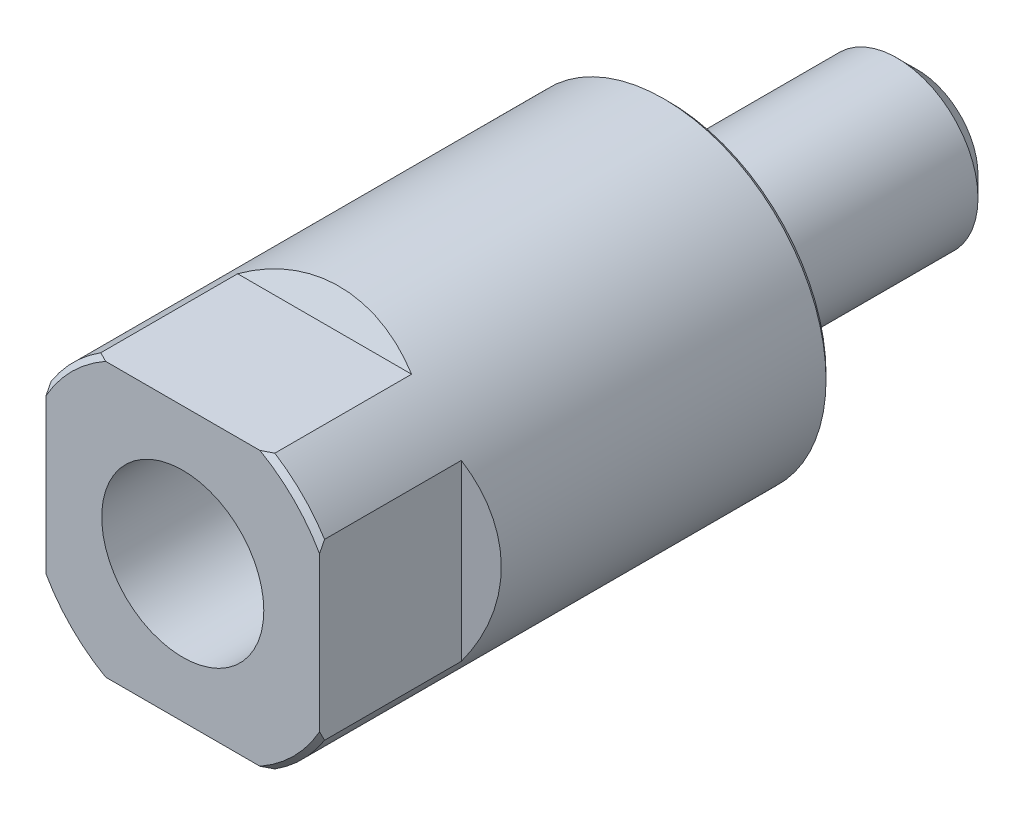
ISO-10303-21;
HEADER;
FILE_DESCRIPTION(('STEP AP214'),'2;1');
FILE_NAME('part.step','',(''),(''),'','','');
FILE_SCHEMA(('AUTOMOTIVE_DESIGN { 1 0 10303 214 1 1 1 1 }'));
ENDSEC;
DATA;
#1=APPLICATION_CONTEXT('core data for automotive mechanical design processes');
#2=APPLICATION_PROTOCOL_DEFINITION('international standard','automotive_design',2000,#1);
#3=PRODUCT_CONTEXT('',#1,'mechanical');
#4=PRODUCT('Part','Part','',(#3));
#5=PRODUCT_RELATED_PRODUCT_CATEGORY('part','',(#4));
#6=PRODUCT_DEFINITION_FORMATION('','',#4);
#7=PRODUCT_DEFINITION_CONTEXT('part definition',#1,'design');
#8=PRODUCT_DEFINITION('design','',#6,#7);
#9=PRODUCT_DEFINITION_SHAPE('','',#8);
#10=(LENGTH_UNIT() NAMED_UNIT(*) SI_UNIT(.MILLI.,.METRE.));
#11=(NAMED_UNIT(*) PLANE_ANGLE_UNIT() SI_UNIT($,.RADIAN.));
#12=(NAMED_UNIT(*) SI_UNIT($,.STERADIAN.) SOLID_ANGLE_UNIT());
#13=UNCERTAINTY_MEASURE_WITH_UNIT(LENGTH_MEASURE(1.E-05),#10,'distance_accuracy_value','');
#14=(GEOMETRIC_REPRESENTATION_CONTEXT(3) GLOBAL_UNCERTAINTY_ASSIGNED_CONTEXT((#13)) GLOBAL_UNIT_ASSIGNED_CONTEXT((#10,
#11,#12)) REPRESENTATION_CONTEXT('',''));
#15=CARTESIAN_POINT('',(0.,0.,0.));
#16=DIRECTION('',(0.,0.,1.));
#17=DIRECTION('',(1.,0.,0.));
#18=AXIS2_PLACEMENT_3D('',#15,#16,#17);
#19=CARTESIAN_POINT('',(0.,0.,-24.5));
#20=DIRECTION('',(0.,0.,1.));
#21=DIRECTION('',(1.,0.,0.));
#22=AXIS2_PLACEMENT_3D('',#19,#20,#21);
#23=PLANE('',#22);
#24=CARTESIAN_POINT('',(0.,0.,-24.5));
#25=DIRECTION('',(0.,0.,1.));
#26=DIRECTION('',(1.,0.,0.));
#27=AXIS2_PLACEMENT_3D('',#24,#25,#26);
#28=CIRCLE('',#27,6.);
#29=CARTESIAN_POINT('',(6.,0.,-24.5));
#30=VERTEX_POINT('',#29);
#31=EDGE_CURVE('E139',#30,#30,#28,.F.);
#32=ORIENTED_EDGE('',*,*,#31,.T.);
#33=EDGE_LOOP('',(#32));
#34=FACE_BOUND('',#33,.T.);
#35=ADVANCED_FACE('F14',(#34),#23,.F.);
#36=CARTESIAN_POINT('',(0.,0.,-4.5));
#37=DIRECTION('',(0.,0.,1.));
#38=DIRECTION('',(1.,0.,0.));
#39=AXIS2_PLACEMENT_3D('',#36,#37,#38);
#40=CYLINDRICAL_SURFACE('',#39,8.);
#41=CARTESIAN_POINT('',(0.,0.,-22.5));
#42=DIRECTION('',(0.,0.,1.));
#43=DIRECTION('',(1.,0.,0.));
#44=AXIS2_PLACEMENT_3D('',#41,#42,#43);
#45=CIRCLE('',#44,8.);
#46=CARTESIAN_POINT('',(8.,0.,-22.5));
#47=VERTEX_POINT('',#46);
#48=EDGE_CURVE('E176',#47,#47,#45,.T.);
#49=ORIENTED_EDGE('',*,*,#48,.T.);
#50=EDGE_LOOP('',(#49));
#51=FACE_BOUND('',#50,.T.);
#52=CARTESIAN_POINT('',(0.,0.,0.));
#53=DIRECTION('',(0.,0.,1.));
#54=DIRECTION('',(1.,0.,0.));
#55=AXIS2_PLACEMENT_3D('',#52,#53,#54);
#56=CIRCLE('',#55,8.);
#57=CARTESIAN_POINT('',(8.,0.,0.));
#58=VERTEX_POINT('',#57);
#59=EDGE_CURVE('E136',#58,#58,#56,.T.);
#60=ORIENTED_EDGE('',*,*,#59,.F.);
#61=EDGE_LOOP('',(#60));
#62=FACE_BOUND('',#61,.T.);
#63=ADVANCED_FACE('F239',(#51,#62),#40,.T.);
#64=CARTESIAN_POINT('',(8.,0.,15.5));
#65=DIRECTION('',(0.,0.,-1.));
#66=DIRECTION('',(-1.,0.,0.));
#67=AXIS2_PLACEMENT_3D('',#64,#65,#66);
#68=PLANE('',#67);
#69=CARTESIAN_POINT('',(0.,0.,15.5));
#70=DIRECTION('',(0.,0.,1.));
#71=DIRECTION('',(1.,0.,0.));
#72=AXIS2_PLACEMENT_3D('',#69,#70,#71);
#73=CIRCLE('',#72,8.);
#74=CARTESIAN_POINT('',(8.,0.,15.5));
#75=VERTEX_POINT('',#74);
#76=EDGE_CURVE('E122',#75,#75,#73,.T.);
#77=ORIENTED_EDGE('',*,*,#76,.T.);
#78=EDGE_LOOP('',(#77));
#79=FACE_BOUND('',#78,.T.);
#80=ADVANCED_FACE('F223',(#79),#68,.F.);
#81=CARTESIAN_POINT('',(13.5,-16.,34.));
#82=DIRECTION('',(-0.500000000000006,0.,-0.866025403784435));
#83=DIRECTION('',(-0.866025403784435,0.,0.500000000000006));
#84=AXIS2_PLACEMENT_3D('',#81,#82,#83);
#85=PLANE('',#84);
#86=CARTESIAN_POINT('',(0.,0.,41.7942286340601));
#87=DIRECTION('',(-0.500000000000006,0.,-0.866025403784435));
#88=DIRECTION('',(0.866025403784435,0.,-0.500000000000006));
#89=AXIS2_PLACEMENT_3D('',#86,#87,#88);
#90=ELLIPSE('',#89,18.4752086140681,16.);
#91=CARTESIAN_POINT('',(13.5,8.58778201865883,34.));
#92=VERTEX_POINT('',#91);
#93=CARTESIAN_POINT('',(13.5,-8.58778201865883,34.));
#94=VERTEX_POINT('',#93);
#95=EDGE_CURVE('E159',#92,#94,#90,.T.);
#96=ORIENTED_EDGE('',*,*,#95,.F.);
#97=DIRECTION('',(0.,1.,0.));
#98=VECTOR('',#97,1.);
#99=CARTESIAN_POINT('',(13.5,-16.,34.));
#100=LINE('',#99,#98);
#101=EDGE_CURVE('E149',#94,#92,#100,.T.);
#102=ORIENTED_EDGE('',*,*,#101,.F.);
#103=EDGE_LOOP('',(#96,#102));
#104=FACE_BOUND('',#103,.T.);
#105=ADVANCED_FACE('F214',(#104),#85,.F.);
#106=CARTESIAN_POINT('',(13.5,-16.,48.));
#107=DIRECTION('',(-1.,0.,0.));
#108=DIRECTION('',(0.,0.,1.));
#109=AXIS2_PLACEMENT_3D('',#106,#107,#108);
#110=PLANE('',#109);
#111=DIRECTION('',(0.,-1.,0.));
#112=VECTOR('',#111,1.);
#113=CARTESIAN_POINT('',(13.5,0.,48.));
#114=LINE('',#113,#112);
#115=CARTESIAN_POINT('',(13.5,7.61577310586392,48.));
#116=VERTEX_POINT('',#115);
#117=CARTESIAN_POINT('',(13.5,-7.61577310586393,48.));
#118=VERTEX_POINT('',#117);
#119=EDGE_CURVE('E156',#116,#118,#114,.T.);
#120=ORIENTED_EDGE('',*,*,#119,.T.);
#121=CARTESIAN_POINT('',(13.5,-7.61577310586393,48.));
#122=CARTESIAN_POINT('',(13.5,-7.6975348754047,47.9598269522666));
#123=CARTESIAN_POINT('',(13.5,-7.77910228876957,47.919259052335));
#124=CARTESIAN_POINT('',(13.5,-7.94184922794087,47.8373685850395));
#125=CARTESIAN_POINT('',(13.5,-8.02302878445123,47.7960460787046));
#126=CARTESIAN_POINT('',(13.5,-8.18501366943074,47.7126751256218));
#127=CARTESIAN_POINT('',(13.5,-8.2658189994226,47.6706266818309));
#128=CARTESIAN_POINT('',(13.5,-8.42706999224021,47.5858299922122));
#129=CARTESIAN_POINT('',(13.5,-8.50751562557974,47.5430816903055));
#130=CARTESIAN_POINT('',(13.5,-8.58778201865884,47.5));
#131=B_SPLINE_CURVE_WITH_KNOTS('',3,(#121,#122,#123,#124,#125,#126,#127,#128,#129,#130),
.UNSPECIFIED.,.F.,.F.,(4,2,2,2,4),(0.,0.273292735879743,0.546563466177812,0.819833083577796,
1.09312470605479),.UNSPECIFIED.);
#132=CARTESIAN_POINT('',(13.5,-8.58778201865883,47.5));
#133=VERTEX_POINT('',#132);
#134=EDGE_CURVE('E198',#118,#133,#131,.T.);
#135=ORIENTED_EDGE('',*,*,#134,.T.);
#136=DIRECTION('',(0.,0.,-1.));
#137=VECTOR('',#136,1.);
#138=CARTESIAN_POINT('',(13.5,-8.58778201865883,48.));
#139=LINE('',#138,#137);
#140=EDGE_CURVE('E152',#94,#133,#139,.F.);
#141=ORIENTED_EDGE('',*,*,#140,.F.);
#142=ORIENTED_EDGE('',*,*,#101,.T.);
#143=DIRECTION('',(0.,0.,-1.));
#144=VECTOR('',#143,1.);
#145=CARTESIAN_POINT('',(13.5,8.58778201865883,48.));
#146=LINE('',#145,#144);
#147=CARTESIAN_POINT('',(13.5,8.58778201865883,47.5));
#148=VERTEX_POINT('',#147);
#149=EDGE_CURVE('E154',#148,#92,#146,.T.);
#150=ORIENTED_EDGE('',*,*,#149,.F.);
#151=CARTESIAN_POINT('',(13.5,8.58778201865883,47.5));
#152=CARTESIAN_POINT('',(13.5,8.50751562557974,47.5430816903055));
#153=CARTESIAN_POINT('',(13.5,8.42706999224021,47.5858299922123));
#154=CARTESIAN_POINT('',(13.5,8.2658189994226,47.6706266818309));
#155=CARTESIAN_POINT('',(13.5,8.18501366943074,47.7126751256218));
#156=CARTESIAN_POINT('',(13.5,8.02302878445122,47.7960460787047));
#157=CARTESIAN_POINT('',(13.5,7.94184922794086,47.8373685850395));
#158=CARTESIAN_POINT('',(13.5,7.77910228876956,47.919259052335));
#159=CARTESIAN_POINT('',(13.5,7.69753487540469,47.9598269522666));
#160=CARTESIAN_POINT('',(13.5,7.61577310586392,48.));
#161=B_SPLINE_CURVE_WITH_KNOTS('',3,(#151,#152,#153,#154,#155,#156,#157,#158,#159,#160),
.UNSPECIFIED.,.F.,.F.,(4,2,2,2,4),(0.,0.273291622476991,0.546561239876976,0.819831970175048,
1.09312470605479),.UNSPECIFIED.);
#162=EDGE_CURVE('E191',#148,#116,#161,.T.);
#163=ORIENTED_EDGE('',*,*,#162,.T.);
#164=EDGE_LOOP('',(#120,#135,#141,#142,#150,#163));
#165=FACE_BOUND('',#164,.T.);
#166=ADVANCED_FACE('F208',(#165),#110,.F.);
#167=CARTESIAN_POINT('',(16.,13.5,34.));
#168=DIRECTION('',(0.,-0.500000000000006,-0.866025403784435));
#169=DIRECTION('',(0.,0.866025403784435,-0.500000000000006));
#170=AXIS2_PLACEMENT_3D('',#167,#168,#169);
#171=PLANE('',#170);
#172=CARTESIAN_POINT('',(0.,0.,41.7942286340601));
#173=DIRECTION('',(0.,-0.500000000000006,-0.866025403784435));
#174=DIRECTION('',(0.,0.866025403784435,-0.500000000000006));
#175=AXIS2_PLACEMENT_3D('',#172,#173,#174);
#176=ELLIPSE('',#175,18.4752086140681,16.);
#177=CARTESIAN_POINT('',(-8.58778201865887,13.5,34.));
#178=VERTEX_POINT('',#177);
#179=CARTESIAN_POINT('',(8.58778201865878,13.5,34.));
#180=VERTEX_POINT('',#179);
#181=EDGE_CURVE('E168',#178,#180,#176,.T.);
#182=ORIENTED_EDGE('',*,*,#181,.F.);
#183=DIRECTION('',(-1.,0.,0.));
#184=VECTOR('',#183,1.);
#185=CARTESIAN_POINT('',(16.,13.5,34.));
#186=LINE('',#185,#184);
#187=EDGE_CURVE('E115',#180,#178,#186,.T.);
#188=ORIENTED_EDGE('',*,*,#187,.F.);
#189=EDGE_LOOP('',(#182,#188));
#190=FACE_BOUND('',#189,.T.);
#191=ADVANCED_FACE('F213',(#190),#171,.F.);
#192=CARTESIAN_POINT('',(16.,13.5,48.));
#193=DIRECTION('',(0.,-1.,0.));
#194=DIRECTION('',(1.,0.,0.));
#195=AXIS2_PLACEMENT_3D('',#192,#193,#194);
#196=PLANE('',#195);
#197=DIRECTION('',(0.,0.,-1.));
#198=VECTOR('',#197,1.);
#199=CARTESIAN_POINT('',(-8.58778201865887,13.5,48.));
#200=LINE('',#199,#198);
#201=CARTESIAN_POINT('',(-8.58778201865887,13.5,47.5));
#202=VERTEX_POINT('',#201);
#203=EDGE_CURVE('E133',#202,#178,#200,.T.);
#204=ORIENTED_EDGE('',*,*,#203,.F.);
#205=CARTESIAN_POINT('',(-8.58778201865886,13.5,47.5));
#206=CARTESIAN_POINT('',(-8.50751562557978,13.4999999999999,47.5430816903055));
#207=CARTESIAN_POINT('',(-8.42706999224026,13.4999999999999,47.5858299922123));
#208=CARTESIAN_POINT('',(-8.26581899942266,13.4999999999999,47.6706266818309));
#209=CARTESIAN_POINT('',(-8.18501366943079,13.4999999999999,47.7126751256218));
#210=CARTESIAN_POINT('',(-8.02302878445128,13.4999999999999,47.7960460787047));
#211=CARTESIAN_POINT('',(-7.94184922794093,13.4999999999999,47.8373685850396));
#212=CARTESIAN_POINT('',(-7.77910228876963,13.4999999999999,47.919259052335));
#213=CARTESIAN_POINT('',(-7.69753487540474,13.4999999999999,47.9598269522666));
#214=CARTESIAN_POINT('',(-7.61577310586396,13.5,48.));
#215=B_SPLINE_CURVE_WITH_KNOTS('',3,(#205,#206,#207,#208,#209,#210,#211,#212,#213,#214),
.UNSPECIFIED.,.F.,.F.,(4,2,2,2,4),(0.,0.273291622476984,0.546561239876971,0.819831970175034,
1.09312470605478),.UNSPECIFIED.);
#216=CARTESIAN_POINT('',(-7.61577310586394,13.5,48.));
#217=VERTEX_POINT('',#216);
#218=EDGE_CURVE('E22',#202,#217,#215,.T.);
#219=ORIENTED_EDGE('',*,*,#218,.T.);
#220=DIRECTION('',(1.,0.,0.));
#221=VECTOR('',#220,1.);
#222=CARTESIAN_POINT('',(0.,13.5,48.));
#223=LINE('',#222,#221);
#224=CARTESIAN_POINT('',(7.61577310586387,13.5,48.));
#225=VERTEX_POINT('',#224);
#226=EDGE_CURVE('E166',#217,#225,#223,.T.);
#227=ORIENTED_EDGE('',*,*,#226,.T.);
#228=CARTESIAN_POINT('',(7.61577310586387,13.5,48.));
#229=CARTESIAN_POINT('',(7.69753487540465,13.5,47.9598269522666));
#230=CARTESIAN_POINT('',(7.77910228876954,13.5,47.919259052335));
#231=CARTESIAN_POINT('',(7.94184922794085,13.5,47.8373685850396));
#232=CARTESIAN_POINT('',(8.0230287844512,13.5,47.7960460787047));
#233=CARTESIAN_POINT('',(8.18501366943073,13.5,47.7126751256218));
#234=CARTESIAN_POINT('',(8.26581899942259,13.5,47.6706266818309));
#235=CARTESIAN_POINT('',(8.4270699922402,13.5,47.5858299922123));
#236=CARTESIAN_POINT('',(8.50751562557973,13.5,47.5430816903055));
#237=CARTESIAN_POINT('',(8.58778201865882,13.5,47.5));
#238=B_SPLINE_CURVE_WITH_KNOTS('',3,(#228,#229,#230,#231,#232,#233,#234,#235,#236,#237),
.UNSPECIFIED.,.F.,.F.,(4,2,2,2,4),(0.,0.273292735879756,0.546563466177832,0.819833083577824,
1.09312470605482),.UNSPECIFIED.);
#239=CARTESIAN_POINT('',(8.58778201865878,13.5,47.5));
#240=VERTEX_POINT('',#239);
#241=EDGE_CURVE('E29',#225,#240,#238,.T.);
#242=ORIENTED_EDGE('',*,*,#241,.T.);
#243=DIRECTION('',(0.,0.,-1.));
#244=VECTOR('',#243,1.);
#245=CARTESIAN_POINT('',(8.58778201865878,13.5,48.));
#246=LINE('',#245,#244);
#247=EDGE_CURVE('E131',#180,#240,#246,.F.);
#248=ORIENTED_EDGE('',*,*,#247,.F.);
#249=ORIENTED_EDGE('',*,*,#187,.T.);
#250=EDGE_LOOP('',(#204,#219,#227,#242,#248,#249));
#251=FACE_BOUND('',#250,.T.);
#252=ADVANCED_FACE('F283',(#251),#196,.F.);
#253=CARTESIAN_POINT('',(-13.5,-16.,34.));
#254=DIRECTION('',(0.5,0.,-0.866025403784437));
#255=DIRECTION('',(-0.866025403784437,0.,-0.5));
#256=AXIS2_PLACEMENT_3D('',#253,#254,#255);
#257=PLANE('',#256);
#258=CARTESIAN_POINT('',(0.,0.,41.79422863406));
#259=DIRECTION('',(0.5,0.,-0.866025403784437));
#260=DIRECTION('',(-0.866025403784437,0.,-0.5));
#261=AXIS2_PLACEMENT_3D('',#258,#259,#260);
#262=ELLIPSE('',#261,18.475208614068,16.);
#263=CARTESIAN_POINT('',(-13.5,-8.58778201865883,34.));
#264=VERTEX_POINT('',#263);
#265=CARTESIAN_POINT('',(-13.5,8.58778201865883,34.));
#266=VERTEX_POINT('',#265);
#267=EDGE_CURVE('E164',#264,#266,#262,.T.);
#268=ORIENTED_EDGE('',*,*,#267,.F.);
#269=DIRECTION('',(0.,1.,0.));
#270=VECTOR('',#269,1.);
#271=CARTESIAN_POINT('',(-13.5,-16.,34.));
#272=LINE('',#271,#270);
#273=EDGE_CURVE('E142',#264,#266,#272,.T.);
#274=ORIENTED_EDGE('',*,*,#273,.T.);
#275=EDGE_LOOP('',(#268,#274));
#276=FACE_BOUND('',#275,.T.);
#277=ADVANCED_FACE('F216',(#276),#257,.F.);
#278=CARTESIAN_POINT('',(-13.5,-16.,48.));
#279=DIRECTION('',(1.,0.,0.));
#280=DIRECTION('',(0.,0.,-1.));
#281=AXIS2_PLACEMENT_3D('',#278,#279,#280);
#282=PLANE('',#281);
#283=DIRECTION('',(0.,0.,-1.));
#284=VECTOR('',#283,1.);
#285=CARTESIAN_POINT('',(-13.5,-8.58778201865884,48.));
#286=LINE('',#285,#284);
#287=CARTESIAN_POINT('',(-13.5,-8.58778201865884,47.5));
#288=VERTEX_POINT('',#287);
#289=EDGE_CURVE('E147',#288,#264,#286,.T.);
#290=ORIENTED_EDGE('',*,*,#289,.F.);
#291=CARTESIAN_POINT('',(-13.5,-8.58778201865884,47.5));
#292=CARTESIAN_POINT('',(-13.5,-8.50751562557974,47.5430816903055));
#293=CARTESIAN_POINT('',(-13.5,-8.42706999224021,47.5858299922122));
#294=CARTESIAN_POINT('',(-13.5,-8.2658189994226,47.6706266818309));
#295=CARTESIAN_POINT('',(-13.5,-8.18501366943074,47.7126751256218));
#296=CARTESIAN_POINT('',(-13.5,-8.02302878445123,47.7960460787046));
#297=CARTESIAN_POINT('',(-13.5,-7.94184922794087,47.8373685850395));
#298=CARTESIAN_POINT('',(-13.5,-7.77910228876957,47.919259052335));
#299=CARTESIAN_POINT('',(-13.5,-7.6975348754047,47.9598269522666));
#300=CARTESIAN_POINT('',(-13.5,-7.61577310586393,48.));
#301=B_SPLINE_CURVE_WITH_KNOTS('',3,(#291,#292,#293,#294,#295,#296,#297,#298,#299,#300),
.UNSPECIFIED.,.F.,.F.,(4,2,2,2,4),(0.,0.273291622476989,0.546561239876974,0.819831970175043,
1.09312470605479),.UNSPECIFIED.);
#302=CARTESIAN_POINT('',(-13.5,-7.61577310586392,48.));
#303=VERTEX_POINT('',#302);
#304=EDGE_CURVE('E323',#288,#303,#301,.T.);
#305=ORIENTED_EDGE('',*,*,#304,.T.);
#306=DIRECTION('',(0.,1.,0.));
#307=VECTOR('',#306,1.);
#308=CARTESIAN_POINT('',(-13.5,0.,48.));
#309=LINE('',#308,#307);
#310=CARTESIAN_POINT('',(-13.5,7.61577310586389,48.));
#311=VERTEX_POINT('',#310);
#312=EDGE_CURVE('E161',#303,#311,#309,.T.);
#313=ORIENTED_EDGE('',*,*,#312,.T.);
#314=CARTESIAN_POINT('',(-13.5,7.61577310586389,48.));
#315=CARTESIAN_POINT('',(-13.5,7.69753487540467,47.9598269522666));
#316=CARTESIAN_POINT('',(-13.5,7.77910228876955,47.919259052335));
#317=CARTESIAN_POINT('',(-13.5,7.94184922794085,47.8373685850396));
#318=CARTESIAN_POINT('',(-13.5,8.02302878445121,47.7960460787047));
#319=CARTESIAN_POINT('',(-13.5,8.18501366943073,47.7126751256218));
#320=CARTESIAN_POINT('',(-13.5,8.2658189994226,47.6706266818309));
#321=CARTESIAN_POINT('',(-13.5,8.42706999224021,47.5858299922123));
#322=CARTESIAN_POINT('',(-13.5,8.50751562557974,47.5430816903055));
#323=CARTESIAN_POINT('',(-13.5,8.58778201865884,47.5));
#324=B_SPLINE_CURVE_WITH_KNOTS('',3,(#314,#315,#316,#317,#318,#319,#320,#321,#322,#323),
.UNSPECIFIED.,.F.,.F.,(4,2,2,2,4),(0.,0.273292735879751,0.546563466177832,0.819833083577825,
1.09312470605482),.UNSPECIFIED.);
#325=CARTESIAN_POINT('',(-13.5,8.58778201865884,47.5));
#326=VERTEX_POINT('',#325);
#327=EDGE_CURVE('E267',#311,#326,#324,.T.);
#328=ORIENTED_EDGE('',*,*,#327,.T.);
#329=DIRECTION('',(0.,0.,-1.));
#330=VECTOR('',#329,1.);
#331=CARTESIAN_POINT('',(-13.5,8.58778201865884,48.));
#332=LINE('',#331,#330);
#333=EDGE_CURVE('E145',#266,#326,#332,.F.);
#334=ORIENTED_EDGE('',*,*,#333,.F.);
#335=ORIENTED_EDGE('',*,*,#273,.F.);
#336=EDGE_LOOP('',(#290,#305,#313,#328,#334,#335));
#337=FACE_BOUND('',#336,.T.);
#338=ADVANCED_FACE('F217',(#337),#282,.F.);
#339=CARTESIAN_POINT('',(16.,-13.5,34.));
#340=DIRECTION('',(0.,0.5,-0.866025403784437));
#341=DIRECTION('',(0.,0.866025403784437,0.5));
#342=AXIS2_PLACEMENT_3D('',#339,#340,#341);
#343=PLANE('',#342);
#344=CARTESIAN_POINT('',(0.,0.,41.79422863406));
#345=DIRECTION('',(0.,0.5,-0.866025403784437));
#346=DIRECTION('',(0.,-0.866025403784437,-0.5));
#347=AXIS2_PLACEMENT_3D('',#344,#345,#346);
#348=ELLIPSE('',#347,18.475208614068,16.);
#349=CARTESIAN_POINT('',(8.58778201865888,-13.5,34.));
#350=VERTEX_POINT('',#349);
#351=CARTESIAN_POINT('',(-8.58778201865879,-13.5,34.));
#352=VERTEX_POINT('',#351);
#353=EDGE_CURVE('E108',#350,#352,#348,.T.);
#354=ORIENTED_EDGE('',*,*,#353,.F.);
#355=DIRECTION('',(-1.,0.,0.));
#356=VECTOR('',#355,1.);
#357=CARTESIAN_POINT('',(16.,-13.5,34.));
#358=LINE('',#357,#356);
#359=EDGE_CURVE('E121',#350,#352,#358,.T.);
#360=ORIENTED_EDGE('',*,*,#359,.T.);
#361=EDGE_LOOP('',(#354,#360));
#362=FACE_BOUND('',#361,.T.);
#363=ADVANCED_FACE('F120',(#362),#343,.F.);
#364=CARTESIAN_POINT('',(16.,-13.5,48.));
#365=DIRECTION('',(0.,1.,0.));
#366=DIRECTION('',(-1.,0.,0.));
#367=AXIS2_PLACEMENT_3D('',#364,#365,#366);
#368=PLANE('',#367);
#369=DIRECTION('',(0.,0.,-1.));
#370=VECTOR('',#369,1.);
#371=CARTESIAN_POINT('',(8.58778201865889,-13.5,48.));
#372=LINE('',#371,#370);
#373=CARTESIAN_POINT('',(8.58778201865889,-13.5,47.5));
#374=VERTEX_POINT('',#373);
#375=EDGE_CURVE('E103',#374,#350,#372,.T.);
#376=ORIENTED_EDGE('',*,*,#375,.F.);
#377=CARTESIAN_POINT('',(8.58778201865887,-13.5,47.5));
#378=CARTESIAN_POINT('',(8.50751562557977,-13.5,47.5430816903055));
#379=CARTESIAN_POINT('',(8.42706999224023,-13.5,47.5858299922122));
#380=CARTESIAN_POINT('',(8.26581899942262,-13.5,47.6706266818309));
#381=CARTESIAN_POINT('',(8.18501366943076,-13.5,47.7126751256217));
#382=CARTESIAN_POINT('',(8.02302878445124,-13.5,47.7960460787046));
#383=CARTESIAN_POINT('',(7.94184922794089,-13.5,47.8373685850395));
#384=CARTESIAN_POINT('',(7.77910228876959,-13.5,47.919259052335));
#385=CARTESIAN_POINT('',(7.69753487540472,-13.5,47.9598269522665));
#386=CARTESIAN_POINT('',(7.61577310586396,-13.5,48.));
#387=B_SPLINE_CURVE_WITH_KNOTS('',3,(#377,#378,#379,#380,#381,#382,#383,#384,#385,#386),
.UNSPECIFIED.,.F.,.F.,(4,2,2,2,4),(0.,0.27329162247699,0.546561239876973,0.819831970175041,
1.09312470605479),.UNSPECIFIED.);
#388=CARTESIAN_POINT('',(7.61577310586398,-13.5,48.));
#389=VERTEX_POINT('',#388);
#390=EDGE_CURVE('E259',#374,#389,#387,.T.);
#391=ORIENTED_EDGE('',*,*,#390,.T.);
#392=DIRECTION('',(-1.,0.,0.));
#393=VECTOR('',#392,1.);
#394=CARTESIAN_POINT('',(0.,-13.5,48.));
#395=LINE('',#394,#393);
#396=CARTESIAN_POINT('',(-7.61577310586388,-13.5,48.));
#397=VERTEX_POINT('',#396);
#398=EDGE_CURVE('E123',#389,#397,#395,.T.);
#399=ORIENTED_EDGE('',*,*,#398,.T.);
#400=CARTESIAN_POINT('',(-7.61577310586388,-13.5,48.));
#401=CARTESIAN_POINT('',(-7.69753487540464,-13.5000000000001,47.9598269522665));
#402=CARTESIAN_POINT('',(-7.77910228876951,-13.5000000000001,47.919259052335));
#403=CARTESIAN_POINT('',(-7.9418492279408,-13.5000000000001,47.8373685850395));
#404=CARTESIAN_POINT('',(-8.02302878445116,-13.5000000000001,47.7960460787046));
#405=CARTESIAN_POINT('',(-8.18501366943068,-13.5000000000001,47.7126751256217));
#406=CARTESIAN_POINT('',(-8.26581899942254,-13.5000000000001,47.6706266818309));
#407=CARTESIAN_POINT('',(-8.42706999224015,-13.5000000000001,47.5858299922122));
#408=CARTESIAN_POINT('',(-8.50751562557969,-13.5000000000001,47.5430816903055));
#409=CARTESIAN_POINT('',(-8.58778201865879,-13.5,47.5));
#410=B_SPLINE_CURVE_WITH_KNOTS('',3,(#400,#401,#402,#403,#404,#405,#406,#407,#408,#409),
.UNSPECIFIED.,.F.,.F.,(4,2,2,2,4),(0.,0.273292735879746,0.546563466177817,0.819833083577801,
1.09312470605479),.UNSPECIFIED.);
#411=CARTESIAN_POINT('',(-8.5877820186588,-13.5,47.5));
#412=VERTEX_POINT('',#411);
#413=EDGE_CURVE('E268',#397,#412,#410,.T.);
#414=ORIENTED_EDGE('',*,*,#413,.T.);
#415=DIRECTION('',(0.,0.,-1.));
#416=VECTOR('',#415,1.);
#417=CARTESIAN_POINT('',(-8.5877820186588,-13.5,48.));
#418=LINE('',#417,#416);
#419=EDGE_CURVE('E116',#352,#412,#418,.F.);
#420=ORIENTED_EDGE('',*,*,#419,.F.);
#421=ORIENTED_EDGE('',*,*,#359,.F.);
#422=EDGE_LOOP('',(#376,#391,#399,#414,#420,#421));
#423=FACE_BOUND('',#422,.T.);
#424=ADVANCED_FACE('F125',(#423),#368,.F.);
#425=CARTESIAN_POINT('',(0.,0.,48.));
#426=DIRECTION('',(0.,0.,-1.));
#427=DIRECTION('',(-1.,0.,0.));
#428=AXIS2_PLACEMENT_3D('',#425,#426,#427);
#429=CYLINDRICAL_SURFACE('',#428,16.);
#430=CARTESIAN_POINT('',(0.,0.,0.499999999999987));
#431=DIRECTION('',(0.,0.,1.));
#432=DIRECTION('',(1.,0.,0.));
#433=AXIS2_PLACEMENT_3D('',#430,#431,#432);
#434=CIRCLE('',#433,16.);
#435=CARTESIAN_POINT('',(16.,0.,0.499999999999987));
#436=VERTEX_POINT('',#435);
#437=EDGE_CURVE('E343',#436,#436,#434,.T.);
#438=ORIENTED_EDGE('',*,*,#437,.T.);
#439=EDGE_LOOP('',(#438));
#440=FACE_BOUND('',#439,.T.);
#441=ORIENTED_EDGE('',*,*,#140,.T.);
#442=CARTESIAN_POINT('',(0.,0.,47.5));
#443=DIRECTION('',(0.,0.,1.));
#444=DIRECTION('',(1.,0.,0.));
#445=AXIS2_PLACEMENT_3D('',#442,#443,#444);
#446=CIRCLE('',#445,16.);
#447=EDGE_CURVE('E111',#133,#374,#446,.F.);
#448=ORIENTED_EDGE('',*,*,#447,.T.);
#449=ORIENTED_EDGE('',*,*,#375,.T.);
#450=ORIENTED_EDGE('',*,*,#353,.T.);
#451=ORIENTED_EDGE('',*,*,#419,.T.);
#452=CARTESIAN_POINT('',(0.,0.,47.5));
#453=DIRECTION('',(0.,0.,1.));
#454=DIRECTION('',(1.,0.,0.));
#455=AXIS2_PLACEMENT_3D('',#452,#453,#454);
#456=CIRCLE('',#455,16.);
#457=EDGE_CURVE('E337',#412,#288,#456,.F.);
#458=ORIENTED_EDGE('',*,*,#457,.T.);
#459=ORIENTED_EDGE('',*,*,#289,.T.);
#460=ORIENTED_EDGE('',*,*,#267,.T.);
#461=ORIENTED_EDGE('',*,*,#333,.T.);
#462=CARTESIAN_POINT('',(0.,0.,47.5));
#463=DIRECTION('',(0.,0.,1.));
#464=DIRECTION('',(1.,0.,0.));
#465=AXIS2_PLACEMENT_3D('',#462,#463,#464);
#466=CIRCLE('',#465,16.);
#467=EDGE_CURVE('E37',#326,#202,#466,.F.);
#468=ORIENTED_EDGE('',*,*,#467,.T.);
#469=ORIENTED_EDGE('',*,*,#203,.T.);
#470=ORIENTED_EDGE('',*,*,#181,.T.);
#471=ORIENTED_EDGE('',*,*,#247,.T.);
#472=CARTESIAN_POINT('',(0.,0.,47.5));
#473=DIRECTION('',(0.,0.,1.));
#474=DIRECTION('',(1.,0.,0.));
#475=AXIS2_PLACEMENT_3D('',#472,#473,#474);
#476=CIRCLE('',#475,16.);
#477=EDGE_CURVE('E322',#240,#148,#476,.F.);
#478=ORIENTED_EDGE('',*,*,#477,.T.);
#479=ORIENTED_EDGE('',*,*,#149,.T.);
#480=ORIENTED_EDGE('',*,*,#95,.T.);
#481=EDGE_LOOP('',(#441,#448,#449,#450,#451,#458,#459,#460,#461,#468,#469,#470,#471,#478,#479,#480));
#482=FACE_BOUND('',#481,.T.);
#483=ADVANCED_FACE('F106',(#440,#482),#429,.T.);
#484=CARTESIAN_POINT('',(0.,0.,0.));
#485=DIRECTION('',(0.,0.,1.));
#486=DIRECTION('',(1.,0.,0.));
#487=AXIS2_PLACEMENT_3D('',#484,#485,#486);
#488=PLANE('',#487);
#489=CARTESIAN_POINT('',(0.,0.,0.));
#490=DIRECTION('',(0.,0.,1.));
#491=DIRECTION('',(1.,0.,0.));
#492=AXIS2_PLACEMENT_3D('',#489,#490,#491);
#493=CIRCLE('',#492,15.5);
#494=CARTESIAN_POINT('',(15.5,0.,0.));
#495=VERTEX_POINT('',#494);
#496=EDGE_CURVE('E9',#495,#495,#493,.F.);
#497=ORIENTED_EDGE('',*,*,#496,.T.);
#498=EDGE_LOOP('',(#497));
#499=FACE_BOUND('',#498,.T.);
#500=ORIENTED_EDGE('',*,*,#59,.T.);
#501=EDGE_LOOP('',(#500));
#502=FACE_BOUND('',#501,.T.);
#503=ADVANCED_FACE('F225',(#499,#502),#488,.F.);
#504=CARTESIAN_POINT('',(0.,0.,48.));
#505=DIRECTION('',(0.,0.,1.));
#506=DIRECTION('',(1.,0.,0.));
#507=AXIS2_PLACEMENT_3D('',#504,#505,#506);
#508=PLANE('',#507);
#509=ORIENTED_EDGE('',*,*,#398,.F.);
#510=CARTESIAN_POINT('',(0.,0.,48.));
#511=DIRECTION('',(0.,0.,1.));
#512=DIRECTION('',(1.,0.,0.));
#513=AXIS2_PLACEMENT_3D('',#510,#511,#512);
#514=CIRCLE('',#513,15.5);
#515=EDGE_CURVE('E188',#389,#118,#514,.T.);
#516=ORIENTED_EDGE('',*,*,#515,.T.);
#517=ORIENTED_EDGE('',*,*,#119,.F.);
#518=CARTESIAN_POINT('',(0.,0.,48.));
#519=DIRECTION('',(0.,0.,1.));
#520=DIRECTION('',(1.,0.,0.));
#521=AXIS2_PLACEMENT_3D('',#518,#519,#520);
#522=CIRCLE('',#521,15.5);
#523=EDGE_CURVE('E179',#116,#225,#522,.T.);
#524=ORIENTED_EDGE('',*,*,#523,.T.);
#525=ORIENTED_EDGE('',*,*,#226,.F.);
#526=CARTESIAN_POINT('',(0.,0.,48.));
#527=DIRECTION('',(0.,0.,1.));
#528=DIRECTION('',(1.,0.,0.));
#529=AXIS2_PLACEMENT_3D('',#526,#527,#528);
#530=CIRCLE('',#529,15.5);
#531=EDGE_CURVE('E182',#217,#311,#530,.T.);
#532=ORIENTED_EDGE('',*,*,#531,.T.);
#533=ORIENTED_EDGE('',*,*,#312,.F.);
#534=CARTESIAN_POINT('',(0.,0.,48.));
#535=DIRECTION('',(0.,0.,1.));
#536=DIRECTION('',(1.,0.,0.));
#537=AXIS2_PLACEMENT_3D('',#534,#535,#536);
#538=CIRCLE('',#537,15.5);
#539=EDGE_CURVE('E185',#303,#397,#538,.T.);
#540=ORIENTED_EDGE('',*,*,#539,.T.);
#541=EDGE_LOOP('',(#509,#516,#517,#524,#525,#532,#533,#540));
#542=FACE_BOUND('',#541,.T.);
#543=CARTESIAN_POINT('',(0.,0.,48.));
#544=DIRECTION('',(0.,0.,1.));
#545=DIRECTION('',(1.,0.,0.));
#546=AXIS2_PLACEMENT_3D('',#543,#544,#545);
#547=CIRCLE('',#546,8.);
#548=CARTESIAN_POINT('',(8.,0.,48.));
#549=VERTEX_POINT('',#548);
#550=EDGE_CURVE('E135',#549,#549,#547,.T.);
#551=ORIENTED_EDGE('',*,*,#550,.F.);
#552=EDGE_LOOP('',(#551));
#553=FACE_BOUND('',#552,.T.);
#554=ADVANCED_FACE('F228',(#542,#553),#508,.T.);
#555=CARTESIAN_POINT('',(0.,0.,48.));
#556=DIRECTION('',(0.,0.,1.));
#557=DIRECTION('',(1.,0.,0.));
#558=AXIS2_PLACEMENT_3D('',#555,#556,#557);
#559=CYLINDRICAL_SURFACE('',#558,8.);
#560=ORIENTED_EDGE('',*,*,#76,.F.);
#561=EDGE_LOOP('',(#560));
#562=FACE_BOUND('',#561,.T.);
#563=ORIENTED_EDGE('',*,*,#550,.T.);
#564=EDGE_LOOP('',(#563));
#565=FACE_BOUND('',#564,.T.);
#566=ADVANCED_FACE('F232',(#562,#565),#559,.F.);
#567=CARTESIAN_POINT('',(0.,0.,-24.5));
#568=DIRECTION('',(0.,0.,1.));
#569=DIRECTION('',(1.,0.,0.));
#570=AXIS2_PLACEMENT_3D('',#567,#568,#569);
#571=CONICAL_SURFACE('',#570,6.,0.785398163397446);
#572=ORIENTED_EDGE('',*,*,#48,.F.);
#573=EDGE_LOOP('',(#572));
#574=FACE_BOUND('',#573,.T.);
#575=ORIENTED_EDGE('',*,*,#31,.F.);
#576=EDGE_LOOP('',(#575));
#577=FACE_BOUND('',#576,.T.);
#578=ADVANCED_FACE('F241',(#574,#577),#571,.T.);
#579=CARTESIAN_POINT('',(0.,0.,48.));
#580=DIRECTION('',(0.,0.,-1.));
#581=DIRECTION('',(-1.,0.,0.));
#582=AXIS2_PLACEMENT_3D('',#579,#580,#581);
#583=CONICAL_SURFACE('',#582,15.5,0.785398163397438);
#584=ORIENTED_EDGE('',*,*,#390,.F.);
#585=ORIENTED_EDGE('',*,*,#447,.F.);
#586=ORIENTED_EDGE('',*,*,#134,.F.);
#587=ORIENTED_EDGE('',*,*,#515,.F.);
#588=EDGE_LOOP('',(#584,#585,#586,#587));
#589=FACE_BOUND('',#588,.T.);
#590=ADVANCED_FACE('F249',(#589),#583,.T.);
#591=CARTESIAN_POINT('',(0.,0.,48.));
#592=DIRECTION('',(0.,0.,-1.));
#593=DIRECTION('',(-1.,0.,0.));
#594=AXIS2_PLACEMENT_3D('',#591,#592,#593);
#595=CONICAL_SURFACE('',#594,15.5,0.785398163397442);
#596=ORIENTED_EDGE('',*,*,#304,.F.);
#597=ORIENTED_EDGE('',*,*,#457,.F.);
#598=ORIENTED_EDGE('',*,*,#413,.F.);
#599=ORIENTED_EDGE('',*,*,#539,.F.);
#600=EDGE_LOOP('',(#596,#597,#598,#599));
#601=FACE_BOUND('',#600,.T.);
#602=ADVANCED_FACE('F254',(#601),#595,.T.);
#603=CARTESIAN_POINT('',(0.,0.,48.));
#604=DIRECTION('',(0.,0.,-1.));
#605=DIRECTION('',(-1.,0.,0.));
#606=AXIS2_PLACEMENT_3D('',#603,#604,#605);
#607=CONICAL_SURFACE('',#606,15.5,0.785398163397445);
#608=ORIENTED_EDGE('',*,*,#218,.F.);
#609=ORIENTED_EDGE('',*,*,#467,.F.);
#610=ORIENTED_EDGE('',*,*,#327,.F.);
#611=ORIENTED_EDGE('',*,*,#531,.F.);
#612=EDGE_LOOP('',(#608,#609,#610,#611));
#613=FACE_BOUND('',#612,.T.);
#614=ADVANCED_FACE('F299',(#613),#607,.T.);
#615=CARTESIAN_POINT('',(0.,0.,48.));
#616=DIRECTION('',(0.,0.,-1.));
#617=DIRECTION('',(-1.,0.,0.));
#618=AXIS2_PLACEMENT_3D('',#615,#616,#617);
#619=CONICAL_SURFACE('',#618,15.5,0.785398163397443);
#620=ORIENTED_EDGE('',*,*,#162,.F.);
#621=ORIENTED_EDGE('',*,*,#477,.F.);
#622=ORIENTED_EDGE('',*,*,#241,.F.);
#623=ORIENTED_EDGE('',*,*,#523,.F.);
#624=EDGE_LOOP('',(#620,#621,#622,#623));
#625=FACE_BOUND('',#624,.T.);
#626=ADVANCED_FACE('F205',(#625),#619,.T.);
#627=CARTESIAN_POINT('',(0.,0.,0.499999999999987));
#628=DIRECTION('',(0.,0.,1.));
#629=DIRECTION('',(1.,0.,0.));
#630=AXIS2_PLACEMENT_3D('',#627,#628,#629);
#631=CONICAL_SURFACE('',#630,16.,0.785398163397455);
#632=ORIENTED_EDGE('',*,*,#496,.F.);
#633=EDGE_LOOP('',(#632));
#634=FACE_BOUND('',#633,.T.);
#635=ORIENTED_EDGE('',*,*,#437,.F.);
#636=EDGE_LOOP('',(#635));
#637=FACE_BOUND('',#636,.T.);
#638=ADVANCED_FACE('F16',(#634,#637),#631,.T.);
#639=CLOSED_SHELL('',(#35,#63,#80,#105,#166,#191,#252,#277,#338,#363,#424,#483,#503,#554,#566,
#578,#590,#602,#614,#626,#638));
#640=MANIFOLD_SOLID_BREP('B1',#639);
#641=ADVANCED_BREP_SHAPE_REPRESENTATION('',(#18,#640),#14);
#642=SHAPE_DEFINITION_REPRESENTATION(#9,#641);
ENDSEC;
END-ISO-10303-21;
